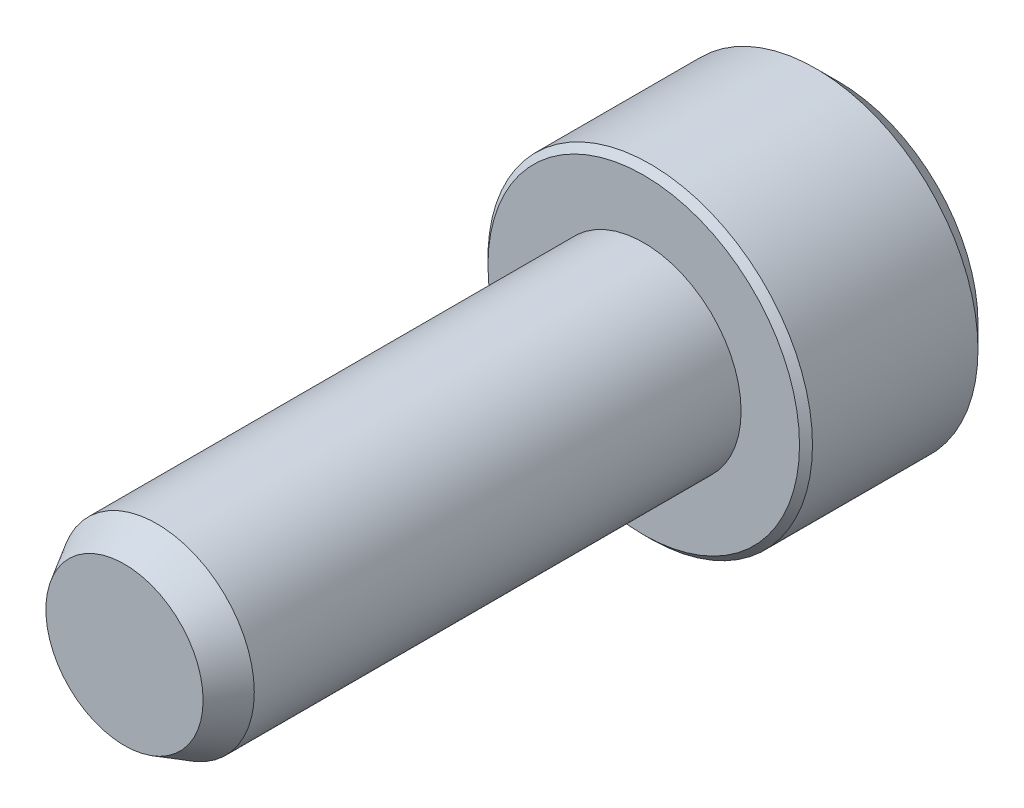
from build123d import *

# Parameters (mm, degrees)
ESQUISSE1_R             = 3
BASE_EXTRUSION_DEPTH    = 16
ESQUISSE2_R             = 5
BOSS_EXTRU_1_DEPTH      = 6
ENL_V_MAT_EXTRU_1_DEPTH = 3
CHANFREIN1_SIZE         = 0.7
CHANFREIN2_SIZE         = 1
CHANFREIN2_SIZE2        = 0.577350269
CHANFREIN3_SIZE         = 0.2


with BuildPart() as part:
    # Esquisse1 → Base-Extrusion (new body)
    with BuildSketch(Plane.XY):
        Circle(ESQUISSE1_R)
    extrude(amount=BASE_EXTRUSION_DEPTH)

    # Esquisse2 → Boss.-Extru.1 (add)
    with BuildSketch(Plane.XY):
        Circle(ESQUISSE2_R)
    extrude(amount=-BOSS_EXTRU_1_DEPTH)

    # Esquisse3 → Enl_v. mat.-Extru.1 (cut)
    with BuildSketch(Plane.XY.offset(-6)):
        Polygon((-1.443375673, 2.5), (1.443375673, 2.5), (2.886751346, 0), (1.443375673, -2.5), (-1.443375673, -2.5), (-2.886751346, 0), align=None)
    extrude(amount=ENL_V_MAT_EXTRU_1_DEPTH, mode=Mode.SUBTRACT)

    # Chanfrein1
    chanfrein1_edges = [part.edges().sort_by_distance(p)[0] for p in [
        (-5, 0, -6),
    ]]
    chamfer(chanfrein1_edges, length=CHANFREIN1_SIZE)

    # Chanfrein2
    chanfrein2_edges = [part.edges().sort_by_distance(p)[0] for p in [
        (-3, 0, 16),
    ]]
    chanfrein2_side = [part.faces().sort_by_distance(p)[0] for p in [
        (-3, 0, 8),
    ]]
    chamfer(chanfrein2_edges, length=CHANFREIN2_SIZE, length2=CHANFREIN2_SIZE2, reference=chanfrein2_side[0])

    # Chanfrein3
    chanfrein3_edges = [part.edges().sort_by_distance(p)[0] for p in [
        (-5, 0, 0),
    ]]
    chamfer(chanfrein3_edges, length=CHANFREIN3_SIZE)


solid = part.part
